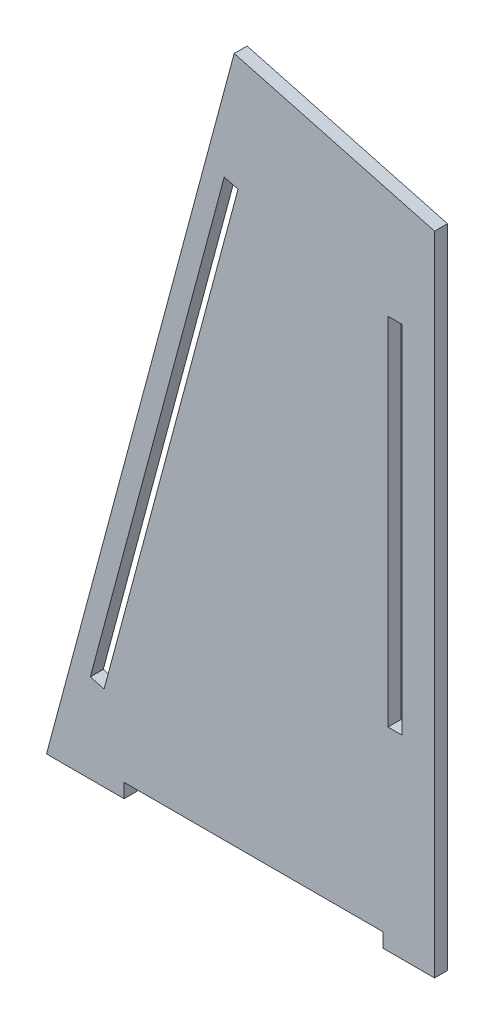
ISO-10303-21;
HEADER;
FILE_DESCRIPTION(('STEP AP214'),'2;1');
FILE_NAME('part.step','',(''),(''),'','','');
FILE_SCHEMA(('AUTOMOTIVE_DESIGN { 1 0 10303 214 1 1 1 1 }'));
ENDSEC;
DATA;
#1=APPLICATION_CONTEXT('core data for automotive mechanical design processes');
#2=APPLICATION_PROTOCOL_DEFINITION('international standard','automotive_design',2000,#1);
#3=PRODUCT_CONTEXT('',#1,'mechanical');
#4=PRODUCT('Part','Part','',(#3));
#5=PRODUCT_RELATED_PRODUCT_CATEGORY('part','',(#4));
#6=PRODUCT_DEFINITION_FORMATION('','',#4);
#7=PRODUCT_DEFINITION_CONTEXT('part definition',#1,'design');
#8=PRODUCT_DEFINITION('design','',#6,#7);
#9=PRODUCT_DEFINITION_SHAPE('','',#8);
#10=(LENGTH_UNIT() NAMED_UNIT(*) SI_UNIT(.MILLI.,.METRE.));
#11=(NAMED_UNIT(*) PLANE_ANGLE_UNIT() SI_UNIT($,.RADIAN.));
#12=(NAMED_UNIT(*) SI_UNIT($,.STERADIAN.) SOLID_ANGLE_UNIT());
#13=UNCERTAINTY_MEASURE_WITH_UNIT(LENGTH_MEASURE(1.E-05),#10,'distance_accuracy_value','');
#14=(GEOMETRIC_REPRESENTATION_CONTEXT(3) GLOBAL_UNCERTAINTY_ASSIGNED_CONTEXT((#13)) GLOBAL_UNIT_ASSIGNED_CONTEXT((#10,
#11,#12)) REPRESENTATION_CONTEXT('',''));
#15=CARTESIAN_POINT('',(0.,0.,0.));
#16=DIRECTION('',(0.,0.,1.));
#17=DIRECTION('',(1.,0.,0.));
#18=AXIS2_PLACEMENT_3D('',#15,#16,#17);
#19=CARTESIAN_POINT('',(60.,0.,2.));
#20=DIRECTION('',(0.,1.,0.));
#21=DIRECTION('',(-1.,0.,0.));
#22=AXIS2_PLACEMENT_3D('',#19,#20,#21);
#23=PLANE('',#22);
#24=DIRECTION('',(1.,0.,0.));
#25=VECTOR('',#24,1.);
#26=CARTESIAN_POINT('',(60.,0.,0.));
#27=LINE('',#26,#25);
#28=CARTESIAN_POINT('',(0.,0.,0.));
#29=VERTEX_POINT('',#28);
#30=CARTESIAN_POINT('',(12.,0.,0.));
#31=VERTEX_POINT('',#30);
#32=EDGE_CURVE('E162',#29,#31,#27,.T.);
#33=ORIENTED_EDGE('',*,*,#32,.T.);
#34=DIRECTION('',(0.,0.,1.));
#35=VECTOR('',#34,1.);
#36=CARTESIAN_POINT('',(12.,0.,0.));
#37=LINE('',#36,#35);
#38=CARTESIAN_POINT('',(12.,0.,2.));
#39=VERTEX_POINT('',#38);
#40=EDGE_CURVE('E146',#31,#39,#37,.T.);
#41=ORIENTED_EDGE('',*,*,#40,.T.);
#42=DIRECTION('',(1.,0.,0.));
#43=VECTOR('',#42,1.);
#44=CARTESIAN_POINT('',(60.,0.,2.));
#45=LINE('',#44,#43);
#46=CARTESIAN_POINT('',(0.,0.,2.));
#47=VERTEX_POINT('',#46);
#48=EDGE_CURVE('E204',#47,#39,#45,.T.);
#49=ORIENTED_EDGE('',*,*,#48,.F.);
#50=DIRECTION('',(0.,0.,-1.));
#51=VECTOR('',#50,1.);
#52=CARTESIAN_POINT('',(0.,0.,2.));
#53=LINE('',#52,#51);
#54=EDGE_CURVE('E169',#47,#29,#53,.T.);
#55=ORIENTED_EDGE('',*,*,#54,.T.);
#56=EDGE_LOOP('',(#33,#41,#49,#55));
#57=FACE_BOUND('',#56,.T.);
#58=ADVANCED_FACE('F33',(#57),#23,.F.);
#59=CARTESIAN_POINT('',(52.,0.,2.));
#60=VERTEX_POINT('',#59);
#61=CARTESIAN_POINT('',(60.,0.,2.));
#62=VERTEX_POINT('',#61);
#63=EDGE_CURVE('E183',#60,#62,#45,.T.);
#64=ORIENTED_EDGE('',*,*,#63,.F.);
#65=DIRECTION('',(0.,0.,1.));
#66=VECTOR('',#65,1.);
#67=CARTESIAN_POINT('',(52.,0.,0.));
#68=LINE('',#67,#66);
#69=CARTESIAN_POINT('',(52.,0.,0.));
#70=VERTEX_POINT('',#69);
#71=EDGE_CURVE('E156',#70,#60,#68,.T.);
#72=ORIENTED_EDGE('',*,*,#71,.F.);
#73=CARTESIAN_POINT('',(60.,0.,0.));
#74=VERTEX_POINT('',#73);
#75=EDGE_CURVE('E171',#70,#74,#27,.T.);
#76=ORIENTED_EDGE('',*,*,#75,.T.);
#77=DIRECTION('',(0.,0.,-1.));
#78=VECTOR('',#77,1.);
#79=CARTESIAN_POINT('',(60.,0.,2.));
#80=LINE('',#79,#78);
#81=EDGE_CURVE('E11',#62,#74,#80,.T.);
#82=ORIENTED_EDGE('',*,*,#81,.F.);
#83=EDGE_LOOP('',(#64,#72,#76,#82));
#84=FACE_BOUND('',#83,.T.);
#85=ADVANCED_FACE('F35',(#84),#23,.F.);
#86=CARTESIAN_POINT('',(60.,100.,2.));
#87=DIRECTION('',(-1.,0.,0.));
#88=DIRECTION('',(0.,-1.,0.));
#89=AXIS2_PLACEMENT_3D('',#86,#87,#88);
#90=PLANE('',#89);
#91=DIRECTION('',(0.,1.,0.));
#92=VECTOR('',#91,1.);
#93=CARTESIAN_POINT('',(60.,100.,0.));
#94=LINE('',#93,#92);
#95=CARTESIAN_POINT('',(60.,100.,0.));
#96=VERTEX_POINT('',#95);
#97=EDGE_CURVE('E170',#74,#96,#94,.T.);
#98=ORIENTED_EDGE('',*,*,#97,.T.);
#99=DIRECTION('',(0.,0.,-1.));
#100=VECTOR('',#99,1.);
#101=CARTESIAN_POINT('',(60.,100.,2.));
#102=LINE('',#101,#100);
#103=CARTESIAN_POINT('',(60.,100.,2.));
#104=VERTEX_POINT('',#103);
#105=EDGE_CURVE('E41',#104,#96,#102,.T.);
#106=ORIENTED_EDGE('',*,*,#105,.F.);
#107=DIRECTION('',(0.,1.,0.));
#108=VECTOR('',#107,1.);
#109=CARTESIAN_POINT('',(60.,100.,2.));
#110=LINE('',#109,#108);
#111=EDGE_CURVE('E203',#62,#104,#110,.T.);
#112=ORIENTED_EDGE('',*,*,#111,.F.);
#113=ORIENTED_EDGE('',*,*,#81,.T.);
#114=EDGE_LOOP('',(#98,#106,#112,#113));
#115=FACE_BOUND('',#114,.T.);
#116=ADVANCED_FACE('F291',(#115),#90,.F.);
#117=CARTESIAN_POINT('',(29.0192378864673,108.301270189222,2.));
#118=DIRECTION('',(-0.258819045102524,-0.965925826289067,0.));
#119=DIRECTION('',(0.965925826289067,-0.258819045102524,0.));
#120=AXIS2_PLACEMENT_3D('',#117,#118,#119);
#121=PLANE('',#120);
#122=DIRECTION('',(-0.965925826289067,0.258819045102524,0.));
#123=VECTOR('',#122,1.);
#124=CARTESIAN_POINT('',(29.0192378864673,108.301270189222,0.));
#125=LINE('',#124,#123);
#126=CARTESIAN_POINT('',(29.0192378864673,108.301270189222,0.));
#127=VERTEX_POINT('',#126);
#128=EDGE_CURVE('E173',#96,#127,#125,.T.);
#129=ORIENTED_EDGE('',*,*,#128,.T.);
#130=DIRECTION('',(0.,0.,-1.));
#131=VECTOR('',#130,1.);
#132=CARTESIAN_POINT('',(29.0192378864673,108.301270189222,2.));
#133=LINE('',#132,#131);
#134=CARTESIAN_POINT('',(29.0192378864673,108.301270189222,2.));
#135=VERTEX_POINT('',#134);
#136=EDGE_CURVE('E185',#135,#127,#133,.T.);
#137=ORIENTED_EDGE('',*,*,#136,.F.);
#138=DIRECTION('',(-0.965925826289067,0.258819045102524,0.));
#139=VECTOR('',#138,1.);
#140=CARTESIAN_POINT('',(29.0192378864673,108.301270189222,2.));
#141=LINE('',#140,#139);
#142=EDGE_CURVE('E194',#104,#135,#141,.T.);
#143=ORIENTED_EDGE('',*,*,#142,.F.);
#144=ORIENTED_EDGE('',*,*,#105,.T.);
#145=EDGE_LOOP('',(#129,#137,#143,#144));
#146=FACE_BOUND('',#145,.T.);
#147=ADVANCED_FACE('F192',(#146),#121,.F.);
#148=CARTESIAN_POINT('',(0.,0.,2.));
#149=DIRECTION('',(0.965925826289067,-0.258819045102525,0.));
#150=DIRECTION('',(0.258819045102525,0.965925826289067,0.));
#151=AXIS2_PLACEMENT_3D('',#148,#149,#150);
#152=PLANE('',#151);
#153=DIRECTION('',(-0.258819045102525,-0.965925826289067,0.));
#154=VECTOR('',#153,1.);
#155=CARTESIAN_POINT('',(0.,0.,0.));
#156=LINE('',#155,#154);
#157=EDGE_CURVE('E181',#127,#29,#156,.T.);
#158=ORIENTED_EDGE('',*,*,#157,.T.);
#159=ORIENTED_EDGE('',*,*,#54,.F.);
#160=DIRECTION('',(-0.258819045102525,-0.965925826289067,0.));
#161=VECTOR('',#160,1.);
#162=CARTESIAN_POINT('',(0.,0.,2.));
#163=LINE('',#162,#161);
#164=EDGE_CURVE('E177',#135,#47,#163,.T.);
#165=ORIENTED_EDGE('',*,*,#164,.F.);
#166=ORIENTED_EDGE('',*,*,#136,.T.);
#167=EDGE_LOOP('',(#158,#159,#165,#166));
#168=FACE_BOUND('',#167,.T.);
#169=ADVANCED_FACE('F200',(#168),#152,.F.);
#170=CARTESIAN_POINT('',(0.,0.,2.));
#171=DIRECTION('',(0.,0.,1.));
#172=DIRECTION('',(1.,0.,0.));
#173=AXIS2_PLACEMENT_3D('',#170,#171,#172);
#174=PLANE('',#173);
#175=DIRECTION('',(0.,-1.,0.));
#176=VECTOR('',#175,1.);
#177=CARTESIAN_POINT('',(12.,2.2,2.));
#178=LINE('',#177,#176);
#179=CARTESIAN_POINT('',(12.,2.2,2.));
#180=VERTEX_POINT('',#179);
#181=EDGE_CURVE('E151',#180,#39,#178,.T.);
#182=ORIENTED_EDGE('',*,*,#181,.F.);
#183=DIRECTION('',(-1.,0.,0.));
#184=VECTOR('',#183,1.);
#185=CARTESIAN_POINT('',(12.,2.2,2.));
#186=LINE('',#185,#184);
#187=CARTESIAN_POINT('',(52.,2.2,2.));
#188=VERTEX_POINT('',#187);
#189=EDGE_CURVE('E165',#188,#180,#186,.T.);
#190=ORIENTED_EDGE('',*,*,#189,.F.);
#191=DIRECTION('',(0.,1.,0.));
#192=VECTOR('',#191,1.);
#193=CARTESIAN_POINT('',(52.,2.2,2.));
#194=LINE('',#193,#192);
#195=EDGE_CURVE('E276',#60,#188,#194,.T.);
#196=ORIENTED_EDGE('',*,*,#195,.F.);
#197=ORIENTED_EDGE('',*,*,#63,.T.);
#198=ORIENTED_EDGE('',*,*,#111,.T.);
#199=ORIENTED_EDGE('',*,*,#142,.T.);
#200=ORIENTED_EDGE('',*,*,#164,.T.);
#201=ORIENTED_EDGE('',*,*,#48,.T.);
#202=EDGE_LOOP('',(#182,#190,#196,#197,#198,#199,#200,#201));
#203=FACE_BOUND('',#202,.T.);
#204=DIRECTION('',(0.,-1.,0.));
#205=VECTOR('',#204,1.);
#206=CARTESIAN_POINT('',(52.8,85.,2.));
#207=LINE('',#206,#205);
#208=CARTESIAN_POINT('',(52.8,85.,2.));
#209=VERTEX_POINT('',#208);
#210=CARTESIAN_POINT('',(52.8,30.,2.));
#211=VERTEX_POINT('',#210);
#212=EDGE_CURVE('E48',#209,#211,#207,.T.);
#213=ORIENTED_EDGE('',*,*,#212,.F.);
#214=DIRECTION('',(-1.,0.,0.));
#215=VECTOR('',#214,1.);
#216=CARTESIAN_POINT('',(52.8,85.,2.));
#217=LINE('',#216,#215);
#218=CARTESIAN_POINT('',(55.,85.,2.));
#219=VERTEX_POINT('',#218);
#220=EDGE_CURVE('E249',#219,#209,#217,.T.);
#221=ORIENTED_EDGE('',*,*,#220,.F.);
#222=DIRECTION('',(0.,1.,0.));
#223=VECTOR('',#222,1.);
#224=CARTESIAN_POINT('',(55.,85.,2.));
#225=LINE('',#224,#223);
#226=CARTESIAN_POINT('',(55.,30.,2.));
#227=VERTEX_POINT('',#226);
#228=EDGE_CURVE('E253',#227,#219,#225,.T.);
#229=ORIENTED_EDGE('',*,*,#228,.F.);
#230=DIRECTION('',(1.,0.,0.));
#231=VECTOR('',#230,1.);
#232=CARTESIAN_POINT('',(52.8,30.,2.));
#233=LINE('',#232,#231);
#234=EDGE_CURVE('E256',#211,#227,#233,.T.);
#235=ORIENTED_EDGE('',*,*,#234,.F.);
#236=EDGE_LOOP('',(#213,#221,#229,#235));
#237=FACE_BOUND('',#236,.T.);
#238=DIRECTION('',(-0.258819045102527,-0.965925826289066,0.));
#239=VECTOR('',#238,1.);
#240=CARTESIAN_POINT('',(6.78006315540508,13.7124302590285,2.));
#241=LINE('',#240,#239);
#242=CARTESIAN_POINT('',(27.4855867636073,90.9864963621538,2.));
#243=VERTEX_POINT('',#242);
#244=CARTESIAN_POINT('',(6.78006315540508,13.7124302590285,2.));
#245=VERTEX_POINT('',#244);
#246=EDGE_CURVE('E227',#243,#245,#241,.T.);
#247=ORIENTED_EDGE('',*,*,#246,.F.);
#248=DIRECTION('',(-0.965925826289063,0.258819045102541,0.));
#249=VECTOR('',#248,1.);
#250=CARTESIAN_POINT('',(27.4855867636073,90.9864963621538,2.));
#251=LINE('',#250,#249);
#252=CARTESIAN_POINT('',(29.6106235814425,90.4170944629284,2.));
#253=VERTEX_POINT('',#252);
#254=EDGE_CURVE('E217',#253,#243,#251,.T.);
#255=ORIENTED_EDGE('',*,*,#254,.F.);
#256=DIRECTION('',(0.258819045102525,0.965925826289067,0.));
#257=VECTOR('',#256,1.);
#258=CARTESIAN_POINT('',(29.6106235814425,90.4170944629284,2.));
#259=LINE('',#258,#257);
#260=CARTESIAN_POINT('',(8.90509997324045,13.1430283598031,2.));
#261=VERTEX_POINT('',#260);
#262=EDGE_CURVE('E221',#261,#253,#259,.T.);
#263=ORIENTED_EDGE('',*,*,#262,.F.);
#264=DIRECTION('',(0.965925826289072,-0.258819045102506,0.));
#265=VECTOR('',#264,1.);
#266=CARTESIAN_POINT('',(8.90509997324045,13.1430283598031,2.));
#267=LINE('',#266,#265);
#268=EDGE_CURVE('E224',#245,#261,#267,.T.);
#269=ORIENTED_EDGE('',*,*,#268,.F.);
#270=EDGE_LOOP('',(#247,#255,#263,#269));
#271=FACE_BOUND('',#270,.T.);
#272=ADVANCED_FACE('F288',(#203,#237,#271),#174,.T.);
#273=CARTESIAN_POINT('',(0.,0.,0.));
#274=DIRECTION('',(0.,0.,1.));
#275=DIRECTION('',(1.,0.,0.));
#276=AXIS2_PLACEMENT_3D('',#273,#274,#275);
#277=PLANE('',#276);
#278=DIRECTION('',(-1.,0.,0.));
#279=VECTOR('',#278,1.);
#280=CARTESIAN_POINT('',(52.8,85.,0.));
#281=LINE('',#280,#279);
#282=CARTESIAN_POINT('',(55.,85.,0.));
#283=VERTEX_POINT('',#282);
#284=CARTESIAN_POINT('',(52.8,85.,0.));
#285=VERTEX_POINT('',#284);
#286=EDGE_CURVE('E243',#283,#285,#281,.T.);
#287=ORIENTED_EDGE('',*,*,#286,.T.);
#288=DIRECTION('',(0.,-1.,0.));
#289=VECTOR('',#288,1.);
#290=CARTESIAN_POINT('',(52.8,85.,0.));
#291=LINE('',#290,#289);
#292=CARTESIAN_POINT('',(52.8,30.,0.));
#293=VERTEX_POINT('',#292);
#294=EDGE_CURVE('E252',#285,#293,#291,.T.);
#295=ORIENTED_EDGE('',*,*,#294,.T.);
#296=DIRECTION('',(1.,0.,0.));
#297=VECTOR('',#296,1.);
#298=CARTESIAN_POINT('',(52.8,30.,0.));
#299=LINE('',#298,#297);
#300=CARTESIAN_POINT('',(55.,30.,0.));
#301=VERTEX_POINT('',#300);
#302=EDGE_CURVE('E265',#293,#301,#299,.T.);
#303=ORIENTED_EDGE('',*,*,#302,.T.);
#304=DIRECTION('',(0.,1.,0.));
#305=VECTOR('',#304,1.);
#306=CARTESIAN_POINT('',(55.,85.,0.));
#307=LINE('',#306,#305);
#308=EDGE_CURVE('E262',#301,#283,#307,.T.);
#309=ORIENTED_EDGE('',*,*,#308,.T.);
#310=EDGE_LOOP('',(#287,#295,#303,#309));
#311=FACE_BOUND('',#310,.T.);
#312=DIRECTION('',(-0.965925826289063,0.258819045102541,0.));
#313=VECTOR('',#312,1.);
#314=CARTESIAN_POINT('',(27.4855867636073,90.9864963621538,0.));
#315=LINE('',#314,#313);
#316=CARTESIAN_POINT('',(29.6106235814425,90.4170944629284,0.));
#317=VERTEX_POINT('',#316);
#318=CARTESIAN_POINT('',(27.4855867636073,90.9864963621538,0.));
#319=VERTEX_POINT('',#318);
#320=EDGE_CURVE('E212',#317,#319,#315,.T.);
#321=ORIENTED_EDGE('',*,*,#320,.T.);
#322=DIRECTION('',(-0.258819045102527,-0.965925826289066,0.));
#323=VECTOR('',#322,1.);
#324=CARTESIAN_POINT('',(6.78006315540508,13.7124302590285,0.));
#325=LINE('',#324,#323);
#326=CARTESIAN_POINT('',(6.78006315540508,13.7124302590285,0.));
#327=VERTEX_POINT('',#326);
#328=EDGE_CURVE('E220',#319,#327,#325,.T.);
#329=ORIENTED_EDGE('',*,*,#328,.T.);
#330=DIRECTION('',(0.965925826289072,-0.258819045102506,0.));
#331=VECTOR('',#330,1.);
#332=CARTESIAN_POINT('',(8.90509997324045,13.1430283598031,0.));
#333=LINE('',#332,#331);
#334=CARTESIAN_POINT('',(8.90509997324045,13.1430283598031,0.));
#335=VERTEX_POINT('',#334);
#336=EDGE_CURVE('E235',#327,#335,#333,.T.);
#337=ORIENTED_EDGE('',*,*,#336,.T.);
#338=DIRECTION('',(0.258819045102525,0.965925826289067,0.));
#339=VECTOR('',#338,1.);
#340=CARTESIAN_POINT('',(29.6106235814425,90.4170944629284,0.));
#341=LINE('',#340,#339);
#342=EDGE_CURVE('E232',#335,#317,#341,.T.);
#343=ORIENTED_EDGE('',*,*,#342,.T.);
#344=EDGE_LOOP('',(#321,#329,#337,#343));
#345=FACE_BOUND('',#344,.T.);
#346=DIRECTION('',(-1.,0.,0.));
#347=VECTOR('',#346,1.);
#348=CARTESIAN_POINT('',(12.,2.2,0.));
#349=LINE('',#348,#347);
#350=CARTESIAN_POINT('',(52.,2.2,0.));
#351=VERTEX_POINT('',#350);
#352=CARTESIAN_POINT('',(12.,2.2,0.));
#353=VERTEX_POINT('',#352);
#354=EDGE_CURVE('E56',#351,#353,#349,.T.);
#355=ORIENTED_EDGE('',*,*,#354,.T.);
#356=DIRECTION('',(0.,-1.,0.));
#357=VECTOR('',#356,1.);
#358=CARTESIAN_POINT('',(12.,2.2,0.));
#359=LINE('',#358,#357);
#360=EDGE_CURVE('E149',#353,#31,#359,.T.);
#361=ORIENTED_EDGE('',*,*,#360,.T.);
#362=ORIENTED_EDGE('',*,*,#32,.F.);
#363=ORIENTED_EDGE('',*,*,#157,.F.);
#364=ORIENTED_EDGE('',*,*,#128,.F.);
#365=ORIENTED_EDGE('',*,*,#97,.F.);
#366=ORIENTED_EDGE('',*,*,#75,.F.);
#367=DIRECTION('',(0.,1.,0.));
#368=VECTOR('',#367,1.);
#369=CARTESIAN_POINT('',(52.,2.2,0.));
#370=LINE('',#369,#368);
#371=EDGE_CURVE('E164',#70,#351,#370,.T.);
#372=ORIENTED_EDGE('',*,*,#371,.T.);
#373=EDGE_LOOP('',(#355,#361,#362,#363,#364,#365,#366,#372));
#374=FACE_BOUND('',#373,.T.);
#375=ADVANCED_FACE('F160',(#311,#345,#374),#277,.F.);
#376=CARTESIAN_POINT('',(6.78006315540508,13.7124302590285,0.));
#377=DIRECTION('',(-0.965925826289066,0.258819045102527,0.));
#378=DIRECTION('',(-0.258819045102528,-0.965925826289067,0.));
#379=AXIS2_PLACEMENT_3D('',#376,#377,#378);
#380=PLANE('',#379);
#381=ORIENTED_EDGE('',*,*,#246,.T.);
#382=DIRECTION('',(0.,0.,1.));
#383=VECTOR('',#382,1.);
#384=CARTESIAN_POINT('',(6.78006315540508,13.7124302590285,0.));
#385=LINE('',#384,#383);
#386=EDGE_CURVE('E208',#327,#245,#385,.T.);
#387=ORIENTED_EDGE('',*,*,#386,.F.);
#388=ORIENTED_EDGE('',*,*,#328,.F.);
#389=DIRECTION('',(0.,0.,1.));
#390=VECTOR('',#389,1.);
#391=CARTESIAN_POINT('',(27.4855867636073,90.9864963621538,0.));
#392=LINE('',#391,#390);
#393=EDGE_CURVE('E175',#319,#243,#392,.T.);
#394=ORIENTED_EDGE('',*,*,#393,.T.);
#395=EDGE_LOOP('',(#381,#387,#388,#394));
#396=FACE_BOUND('',#395,.T.);
#397=ADVANCED_FACE('F326',(#396),#380,.F.);
#398=CARTESIAN_POINT('',(27.4855867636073,90.9864963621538,0.));
#399=DIRECTION('',(0.258819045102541,0.965925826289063,0.));
#400=DIRECTION('',(-0.965925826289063,0.258819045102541,0.));
#401=AXIS2_PLACEMENT_3D('',#398,#399,#400);
#402=PLANE('',#401);
#403=ORIENTED_EDGE('',*,*,#254,.T.);
#404=ORIENTED_EDGE('',*,*,#393,.F.);
#405=ORIENTED_EDGE('',*,*,#320,.F.);
#406=DIRECTION('',(0.,0.,1.));
#407=VECTOR('',#406,1.);
#408=CARTESIAN_POINT('',(29.6106235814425,90.4170944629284,0.));
#409=LINE('',#408,#407);
#410=EDGE_CURVE('E214',#317,#253,#409,.T.);
#411=ORIENTED_EDGE('',*,*,#410,.T.);
#412=EDGE_LOOP('',(#403,#404,#405,#411));
#413=FACE_BOUND('',#412,.T.);
#414=ADVANCED_FACE('F336',(#413),#402,.F.);
#415=CARTESIAN_POINT('',(29.6106235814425,90.4170944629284,0.));
#416=DIRECTION('',(0.965925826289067,-0.258819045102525,0.));
#417=DIRECTION('',(0.258819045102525,0.965925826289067,0.));
#418=AXIS2_PLACEMENT_3D('',#415,#416,#417);
#419=PLANE('',#418);
#420=ORIENTED_EDGE('',*,*,#262,.T.);
#421=ORIENTED_EDGE('',*,*,#410,.F.);
#422=ORIENTED_EDGE('',*,*,#342,.F.);
#423=DIRECTION('',(0.,0.,1.));
#424=VECTOR('',#423,1.);
#425=CARTESIAN_POINT('',(8.90509997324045,13.1430283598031,0.));
#426=LINE('',#425,#424);
#427=EDGE_CURVE('E211',#335,#261,#426,.T.);
#428=ORIENTED_EDGE('',*,*,#427,.T.);
#429=EDGE_LOOP('',(#420,#421,#422,#428));
#430=FACE_BOUND('',#429,.T.);
#431=ADVANCED_FACE('F346',(#430),#419,.F.);
#432=CARTESIAN_POINT('',(8.90509997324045,13.1430283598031,0.));
#433=DIRECTION('',(-0.258819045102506,-0.965925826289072,0.));
#434=DIRECTION('',(0.965925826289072,-0.258819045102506,0.));
#435=AXIS2_PLACEMENT_3D('',#432,#433,#434);
#436=PLANE('',#435);
#437=ORIENTED_EDGE('',*,*,#268,.T.);
#438=ORIENTED_EDGE('',*,*,#427,.F.);
#439=ORIENTED_EDGE('',*,*,#336,.F.);
#440=ORIENTED_EDGE('',*,*,#386,.T.);
#441=EDGE_LOOP('',(#437,#438,#439,#440));
#442=FACE_BOUND('',#441,.T.);
#443=ADVANCED_FACE('F356',(#442),#436,.F.);
#444=CARTESIAN_POINT('',(52.8,85.,0.));
#445=DIRECTION('',(-1.,0.,0.));
#446=DIRECTION('',(0.,-1.,0.));
#447=AXIS2_PLACEMENT_3D('',#444,#445,#446);
#448=PLANE('',#447);
#449=ORIENTED_EDGE('',*,*,#212,.T.);
#450=DIRECTION('',(0.,0.,1.));
#451=VECTOR('',#450,1.);
#452=CARTESIAN_POINT('',(52.8,30.,0.));
#453=LINE('',#452,#451);
#454=EDGE_CURVE('E240',#293,#211,#453,.T.);
#455=ORIENTED_EDGE('',*,*,#454,.F.);
#456=ORIENTED_EDGE('',*,*,#294,.F.);
#457=DIRECTION('',(0.,0.,1.));
#458=VECTOR('',#457,1.);
#459=CARTESIAN_POINT('',(52.8,85.,0.));
#460=LINE('',#459,#458);
#461=EDGE_CURVE('E247',#285,#209,#460,.T.);
#462=ORIENTED_EDGE('',*,*,#461,.T.);
#463=EDGE_LOOP('',(#449,#455,#456,#462));
#464=FACE_BOUND('',#463,.T.);
#465=ADVANCED_FACE('F366',(#464),#448,.F.);
#466=CARTESIAN_POINT('',(52.8,85.,0.));
#467=DIRECTION('',(0.,1.,0.));
#468=DIRECTION('',(-1.,0.,0.));
#469=AXIS2_PLACEMENT_3D('',#466,#467,#468);
#470=PLANE('',#469);
#471=ORIENTED_EDGE('',*,*,#220,.T.);
#472=ORIENTED_EDGE('',*,*,#461,.F.);
#473=ORIENTED_EDGE('',*,*,#286,.F.);
#474=DIRECTION('',(0.,0.,1.));
#475=VECTOR('',#474,1.);
#476=CARTESIAN_POINT('',(55.,85.,0.));
#477=LINE('',#476,#475);
#478=EDGE_CURVE('E245',#283,#219,#477,.T.);
#479=ORIENTED_EDGE('',*,*,#478,.T.);
#480=EDGE_LOOP('',(#471,#472,#473,#479));
#481=FACE_BOUND('',#480,.T.);
#482=ADVANCED_FACE('F376',(#481),#470,.F.);
#483=CARTESIAN_POINT('',(55.,85.,0.));
#484=DIRECTION('',(1.,0.,0.));
#485=DIRECTION('',(0.,1.,0.));
#486=AXIS2_PLACEMENT_3D('',#483,#484,#485);
#487=PLANE('',#486);
#488=ORIENTED_EDGE('',*,*,#228,.T.);
#489=ORIENTED_EDGE('',*,*,#478,.F.);
#490=ORIENTED_EDGE('',*,*,#308,.F.);
#491=DIRECTION('',(0.,0.,1.));
#492=VECTOR('',#491,1.);
#493=CARTESIAN_POINT('',(55.,30.,0.));
#494=LINE('',#493,#492);
#495=EDGE_CURVE('E242',#301,#227,#494,.T.);
#496=ORIENTED_EDGE('',*,*,#495,.T.);
#497=EDGE_LOOP('',(#488,#489,#490,#496));
#498=FACE_BOUND('',#497,.T.);
#499=ADVANCED_FACE('F385',(#498),#487,.F.);
#500=CARTESIAN_POINT('',(52.8,30.,0.));
#501=DIRECTION('',(0.,-1.,0.));
#502=DIRECTION('',(0.,0.,-1.));
#503=AXIS2_PLACEMENT_3D('',#500,#501,#502);
#504=PLANE('',#503);
#505=ORIENTED_EDGE('',*,*,#234,.T.);
#506=ORIENTED_EDGE('',*,*,#495,.F.);
#507=ORIENTED_EDGE('',*,*,#302,.F.);
#508=ORIENTED_EDGE('',*,*,#454,.T.);
#509=EDGE_LOOP('',(#505,#506,#507,#508));
#510=FACE_BOUND('',#509,.T.);
#511=ADVANCED_FACE('F395',(#510),#504,.F.);
#512=CARTESIAN_POINT('',(12.,2.2,0.));
#513=DIRECTION('',(-1.,0.,0.));
#514=DIRECTION('',(0.,0.,1.));
#515=AXIS2_PLACEMENT_3D('',#512,#513,#514);
#516=PLANE('',#515);
#517=ORIENTED_EDGE('',*,*,#181,.T.);
#518=ORIENTED_EDGE('',*,*,#40,.F.);
#519=ORIENTED_EDGE('',*,*,#360,.F.);
#520=DIRECTION('',(0.,0.,1.));
#521=VECTOR('',#520,1.);
#522=CARTESIAN_POINT('',(12.,2.2,0.));
#523=LINE('',#522,#521);
#524=EDGE_CURVE('E229',#353,#180,#523,.T.);
#525=ORIENTED_EDGE('',*,*,#524,.T.);
#526=EDGE_LOOP('',(#517,#518,#519,#525));
#527=FACE_BOUND('',#526,.T.);
#528=ADVANCED_FACE('F148',(#527),#516,.F.);
#529=CARTESIAN_POINT('',(12.,2.2,0.));
#530=DIRECTION('',(0.,1.,0.));
#531=DIRECTION('',(0.,0.,1.));
#532=AXIS2_PLACEMENT_3D('',#529,#530,#531);
#533=PLANE('',#532);
#534=ORIENTED_EDGE('',*,*,#189,.T.);
#535=ORIENTED_EDGE('',*,*,#524,.F.);
#536=ORIENTED_EDGE('',*,*,#354,.F.);
#537=DIRECTION('',(0.,0.,1.));
#538=VECTOR('',#537,1.);
#539=CARTESIAN_POINT('',(52.,2.2,0.));
#540=LINE('',#539,#538);
#541=EDGE_CURVE('E271',#351,#188,#540,.T.);
#542=ORIENTED_EDGE('',*,*,#541,.T.);
#543=EDGE_LOOP('',(#534,#535,#536,#542));
#544=FACE_BOUND('',#543,.T.);
#545=ADVANCED_FACE('F414',(#544),#533,.F.);
#546=CARTESIAN_POINT('',(52.,2.2,0.));
#547=DIRECTION('',(1.,0.,0.));
#548=DIRECTION('',(0.,0.,-1.));
#549=AXIS2_PLACEMENT_3D('',#546,#547,#548);
#550=PLANE('',#549);
#551=ORIENTED_EDGE('',*,*,#195,.T.);
#552=ORIENTED_EDGE('',*,*,#541,.F.);
#553=ORIENTED_EDGE('',*,*,#371,.F.);
#554=ORIENTED_EDGE('',*,*,#71,.T.);
#555=EDGE_LOOP('',(#551,#552,#553,#554));
#556=FACE_BOUND('',#555,.T.);
#557=ADVANCED_FACE('F283',(#556),#550,.F.);
#558=CLOSED_SHELL('',(#58,#85,#116,#147,#169,#272,#375,#397,#414,#431,#443,#465,#482,#499,#511,
#528,#545,#557));
#559=MANIFOLD_SOLID_BREP('B2',#558);
#560=ADVANCED_BREP_SHAPE_REPRESENTATION('',(#18,#559),#14);
#561=SHAPE_DEFINITION_REPRESENTATION(#9,#560);
ENDSEC;
END-ISO-10303-21;
